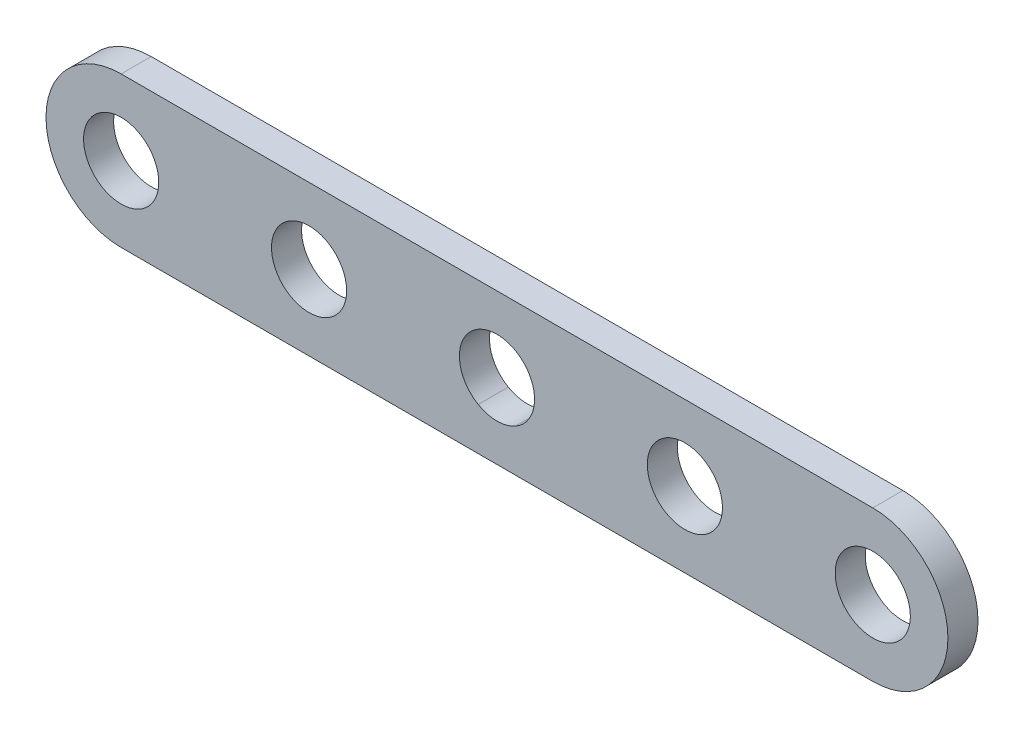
from build123d import *

# Parameters (mm, degrees)
BASE_EXTRUDE_DEPTH = 20
SKETCH2_R          = 25
CUT_EXTRUDE1_DEPTH = 560.374650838
LPATTERN1_COUNT    = 5
LPATTERN1_PITCH    = 125


with BuildPart() as part:
    # Sketch1 → Base-Extrude (new body)
    with BuildSketch(Plane.XY):
        with BuildLine():
            Line((0, 0), (500, 0))
            ThreePointArc((500, 0), (550, 50), (500, 100))
            Line((500, 100), (0, 100))
            ThreePointArc((0, 100), (-50, 50), (0, 0))
        make_face()
    extrude(amount=BASE_EXTRUDE_DEPTH)

    # Sketch2 → Cut-Extrude1 (cut, through all)
    with BuildSketch(Plane.XY.offset(20)):
        with Locations((0, 50)):
            Circle(SKETCH2_R)
    cut_extrude1 = extrude(amount=-CUT_EXTRUDE1_DEPTH, mode=Mode.SUBTRACT)

    # LPattern1: Cut-Extrude1 ×5
    with Locations(*[(i * LPATTERN1_PITCH, 0, 0) for i in range(1, LPATTERN1_COUNT)]):
        add(cut_extrude1, mode=Mode.SUBTRACT)


solid = part.part
